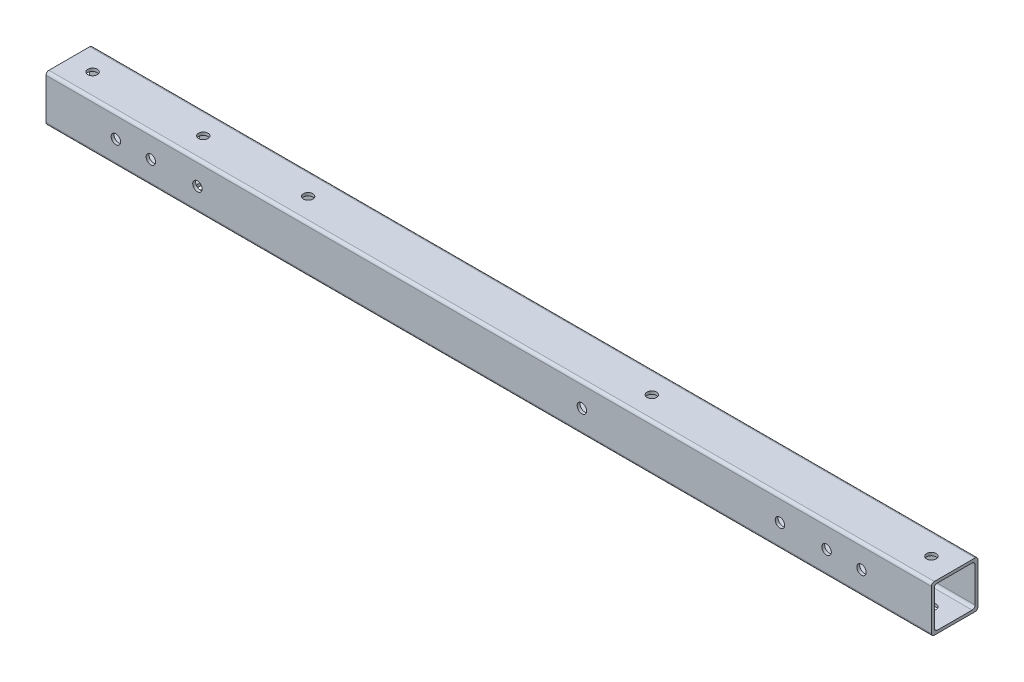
ISO-10303-21;
HEADER;
FILE_DESCRIPTION(('STEP AP214'),'2;1');
FILE_NAME('part.step','',(''),(''),'','','');
FILE_SCHEMA(('AUTOMOTIVE_DESIGN { 1 0 10303 214 1 1 1 1 }'));
ENDSEC;
DATA;
#1=APPLICATION_CONTEXT('core data for automotive mechanical design processes');
#2=APPLICATION_PROTOCOL_DEFINITION('international standard','automotive_design',2000,#1);
#3=PRODUCT_CONTEXT('',#1,'mechanical');
#4=PRODUCT('Part','Part','',(#3));
#5=PRODUCT_RELATED_PRODUCT_CATEGORY('part','',(#4));
#6=PRODUCT_DEFINITION_FORMATION('','',#4);
#7=PRODUCT_DEFINITION_CONTEXT('part definition',#1,'design');
#8=PRODUCT_DEFINITION('design','',#6,#7);
#9=PRODUCT_DEFINITION_SHAPE('','',#8);
#10=(LENGTH_UNIT() NAMED_UNIT(*) SI_UNIT(.MILLI.,.METRE.));
#11=(NAMED_UNIT(*) PLANE_ANGLE_UNIT() SI_UNIT($,.RADIAN.));
#12=(NAMED_UNIT(*) SI_UNIT($,.STERADIAN.) SOLID_ANGLE_UNIT());
#13=UNCERTAINTY_MEASURE_WITH_UNIT(LENGTH_MEASURE(1.E-05),#10,'distance_accuracy_value','');
#14=(GEOMETRIC_REPRESENTATION_CONTEXT(3) GLOBAL_UNCERTAINTY_ASSIGNED_CONTEXT((#13)) GLOBAL_UNIT_ASSIGNED_CONTEXT((#10,
#11,#12)) REPRESENTATION_CONTEXT('',''));
#15=CARTESIAN_POINT('',(0.,0.,0.));
#16=DIRECTION('',(0.,0.,1.));
#17=DIRECTION('',(1.,0.,0.));
#18=AXIS2_PLACEMENT_3D('',#15,#16,#17);
#19=CARTESIAN_POINT('',(0.,101.6,0.));
#20=DIRECTION('',(0.,0.,1.));
#21=DIRECTION('',(1.,0.,0.));
#22=AXIS2_PLACEMENT_3D('',#19,#20,#21);
#23=PLANE('',#22);
#24=CARTESIAN_POINT('',(-762.,50.7999999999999,0.));
#25=DIRECTION('',(0.,0.,-1.));
#26=DIRECTION('',(-1.,0.,0.));
#27=AXIS2_PLACEMENT_3D('',#24,#25,#26);
#28=CIRCLE('',#27,10.31875);
#29=CARTESIAN_POINT('',(-772.31875,50.7999999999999,0.));
#30=VERTEX_POINT('',#29);
#31=EDGE_CURVE('E239',#30,#30,#28,.T.);
#32=ORIENTED_EDGE('',*,*,#31,.F.);
#33=EDGE_LOOP('',(#32));
#34=FACE_BOUND('',#33,.T.);
#35=CARTESIAN_POINT('',(-228.6,50.8,2.08403509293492E-13));
#36=DIRECTION('',(0.,0.,1.));
#37=DIRECTION('',(1.,0.,0.));
#38=AXIS2_PLACEMENT_3D('',#35,#36,#37);
#39=CIRCLE('',#38,10.31875);
#40=CARTESIAN_POINT('',(-218.28125,50.8,2.09667149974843E-13));
#41=VERTEX_POINT('',#40);
#42=EDGE_CURVE('E272',#41,#41,#39,.T.);
#43=ORIENTED_EDGE('',*,*,#42,.T.);
#44=EDGE_LOOP('',(#43));
#45=FACE_BOUND('',#44,.T.);
#46=CARTESIAN_POINT('',(-152.4,50.8,0.));
#47=DIRECTION('',(0.,0.,-1.));
#48=DIRECTION('',(-1.,0.,0.));
#49=AXIS2_PLACEMENT_3D('',#46,#47,#48);
#50=CIRCLE('',#49,10.31875);
#51=CARTESIAN_POINT('',(-162.71875,50.8,0.));
#52=VERTEX_POINT('',#51);
#53=EDGE_CURVE('E279',#52,#52,#50,.T.);
#54=ORIENTED_EDGE('',*,*,#53,.F.);
#55=EDGE_LOOP('',(#54));
#56=FACE_BOUND('',#55,.T.);
#57=CARTESIAN_POINT('',(-1600.2,50.8,1.95961508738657E-13));
#58=DIRECTION('',(0.,0.,-1.));
#59=DIRECTION('',(-1.,0.,0.));
#60=AXIS2_PLACEMENT_3D('',#57,#58,#59);
#61=CIRCLE('',#60,10.31875);
#62=CARTESIAN_POINT('',(-1610.51875,50.8,1.97225149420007E-13));
#63=VERTEX_POINT('',#62);
#64=EDGE_CURVE('E293',#63,#63,#61,.T.);
#65=ORIENTED_EDGE('',*,*,#64,.F.);
#66=EDGE_LOOP('',(#65));
#67=FACE_BOUND('',#66,.T.);
#68=CARTESIAN_POINT('',(-1701.8,50.8,2.08403509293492E-13));
#69=DIRECTION('',(0.,0.,-1.));
#70=DIRECTION('',(-1.,0.,0.));
#71=AXIS2_PLACEMENT_3D('',#68,#69,#70);
#72=CIRCLE('',#71,10.31875);
#73=CARTESIAN_POINT('',(-1712.11875,50.8,2.09667149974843E-13));
#74=VERTEX_POINT('',#73);
#75=EDGE_CURVE('E300',#74,#74,#72,.T.);
#76=ORIENTED_EDGE('',*,*,#75,.F.);
#77=EDGE_LOOP('',(#76));
#78=FACE_BOUND('',#77,.T.);
#79=DIRECTION('',(0.,-1.,0.));
#80=VECTOR('',#79,1.);
#81=CARTESIAN_POINT('',(-1930.4,101.6,2.36398010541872E-13));
#82=LINE('',#81,#80);
#83=CARTESIAN_POINT('',(-1930.4,95.25,2.36398010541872E-13));
#84=VERTEX_POINT('',#83);
#85=CARTESIAN_POINT('',(-1930.4,6.34999999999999,2.36398010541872E-13));
#86=VERTEX_POINT('',#85);
#87=EDGE_CURVE('E358',#84,#86,#82,.T.);
#88=ORIENTED_EDGE('',*,*,#87,.F.);
#89=DIRECTION('',(-1.,0.,0.));
#90=VECTOR('',#89,1.);
#91=CARTESIAN_POINT('',(0.,95.25,0.));
#92=LINE('',#91,#90);
#93=CARTESIAN_POINT('',(0.,95.25,0.));
#94=VERTEX_POINT('',#93);
#95=EDGE_CURVE('E409',#84,#94,#92,.F.);
#96=ORIENTED_EDGE('',*,*,#95,.T.);
#97=DIRECTION('',(0.,-1.,0.));
#98=VECTOR('',#97,1.);
#99=CARTESIAN_POINT('',(0.,101.6,0.));
#100=LINE('',#99,#98);
#101=CARTESIAN_POINT('',(0.,6.34999999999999,0.));
#102=VERTEX_POINT('',#101);
#103=EDGE_CURVE('E160',#94,#102,#100,.T.);
#104=ORIENTED_EDGE('',*,*,#103,.T.);
#105=DIRECTION('',(-1.,0.,0.));
#106=VECTOR('',#105,1.);
#107=CARTESIAN_POINT('',(-1930.4,6.34999999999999,2.36398010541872E-13));
#108=LINE('',#107,#106);
#109=EDGE_CURVE('E407',#102,#86,#108,.T.);
#110=ORIENTED_EDGE('',*,*,#109,.T.);
#111=EDGE_LOOP('',(#88,#96,#104,#110));
#112=FACE_BOUND('',#111,.T.);
#113=CARTESIAN_POINT('',(-1778.,50.8,0.));
#114=DIRECTION('',(0.,0.,1.));
#115=DIRECTION('',(1.,0.,0.));
#116=AXIS2_PLACEMENT_3D('',#113,#114,#115);
#117=CIRCLE('',#116,10.31875);
#118=CARTESIAN_POINT('',(-1767.68125,50.8,0.));
#119=VERTEX_POINT('',#118);
#120=EDGE_CURVE('E307',#119,#119,#117,.T.);
#121=ORIENTED_EDGE('',*,*,#120,.T.);
#122=EDGE_LOOP('',(#121));
#123=FACE_BOUND('',#122,.T.);
#124=CARTESIAN_POINT('',(-330.2,50.8,1.95961508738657E-13));
#125=DIRECTION('',(0.,0.,1.));
#126=DIRECTION('',(1.,0.,0.));
#127=AXIS2_PLACEMENT_3D('',#124,#125,#126);
#128=CIRCLE('',#127,10.31875);
#129=CARTESIAN_POINT('',(-319.88125,50.8,1.97225149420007E-13));
#130=VERTEX_POINT('',#129);
#131=EDGE_CURVE('E265',#130,#130,#128,.T.);
#132=ORIENTED_EDGE('',*,*,#131,.T.);
#133=EDGE_LOOP('',(#132));
#134=FACE_BOUND('',#133,.T.);
#135=ADVANCED_FACE('F31',(#34,#45,#56,#67,#78,#112,#123,#134),#23,.F.);
#136=CARTESIAN_POINT('',(0.,101.6,101.6));
#137=DIRECTION('',(0.,0.,-1.));
#138=DIRECTION('',(-1.,0.,0.));
#139=AXIS2_PLACEMENT_3D('',#136,#137,#138);
#140=PLANE('',#139);
#141=CARTESIAN_POINT('',(-762.,50.7999999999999,101.6));
#142=DIRECTION('',(0.,0.,-1.));
#143=DIRECTION('',(-1.,0.,0.));
#144=AXIS2_PLACEMENT_3D('',#141,#142,#143);
#145=CIRCLE('',#144,10.31875);
#146=CARTESIAN_POINT('',(-772.31875,50.7999999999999,101.6));
#147=VERTEX_POINT('',#146);
#148=EDGE_CURVE('E231',#147,#147,#145,.T.);
#149=ORIENTED_EDGE('',*,*,#148,.T.);
#150=EDGE_LOOP('',(#149));
#151=FACE_BOUND('',#150,.T.);
#152=CARTESIAN_POINT('',(-228.6,50.8,101.6));
#153=DIRECTION('',(0.,0.,1.));
#154=DIRECTION('',(1.,0.,0.));
#155=AXIS2_PLACEMENT_3D('',#152,#153,#154);
#156=CIRCLE('',#155,10.31875);
#157=CARTESIAN_POINT('',(-218.28125,50.8,101.6));
#158=VERTEX_POINT('',#157);
#159=EDGE_CURVE('E217',#158,#158,#156,.T.);
#160=ORIENTED_EDGE('',*,*,#159,.F.);
#161=EDGE_LOOP('',(#160));
#162=FACE_BOUND('',#161,.T.);
#163=CARTESIAN_POINT('',(-152.4,50.8,101.6));
#164=DIRECTION('',(0.,0.,-1.));
#165=DIRECTION('',(-1.,0.,0.));
#166=AXIS2_PLACEMENT_3D('',#163,#164,#165);
#167=CIRCLE('',#166,10.31875);
#168=CARTESIAN_POINT('',(-162.71875,50.8,101.6));
#169=VERTEX_POINT('',#168);
#170=EDGE_CURVE('E212',#169,#169,#167,.T.);
#171=ORIENTED_EDGE('',*,*,#170,.T.);
#172=EDGE_LOOP('',(#171));
#173=FACE_BOUND('',#172,.T.);
#174=CARTESIAN_POINT('',(-1600.2,50.8,101.6));
#175=DIRECTION('',(0.,0.,-1.));
#176=DIRECTION('',(-1.,0.,0.));
#177=AXIS2_PLACEMENT_3D('',#174,#175,#176);
#178=CIRCLE('',#177,10.31875);
#179=CARTESIAN_POINT('',(-1610.51875,50.8,101.6));
#180=VERTEX_POINT('',#179);
#181=EDGE_CURVE('E202',#180,#180,#178,.T.);
#182=ORIENTED_EDGE('',*,*,#181,.T.);
#183=EDGE_LOOP('',(#182));
#184=FACE_BOUND('',#183,.T.);
#185=CARTESIAN_POINT('',(-1701.8,50.8,101.6));
#186=DIRECTION('',(0.,0.,-1.));
#187=DIRECTION('',(-1.,0.,0.));
#188=AXIS2_PLACEMENT_3D('',#185,#186,#187);
#189=CIRCLE('',#188,10.31875);
#190=CARTESIAN_POINT('',(-1712.11875,50.8,101.6));
#191=VERTEX_POINT('',#190);
#192=EDGE_CURVE('E197',#191,#191,#189,.T.);
#193=ORIENTED_EDGE('',*,*,#192,.T.);
#194=EDGE_LOOP('',(#193));
#195=FACE_BOUND('',#194,.T.);
#196=DIRECTION('',(0.,-1.,0.));
#197=VECTOR('',#196,1.);
#198=CARTESIAN_POINT('',(-1930.4,101.6,101.6));
#199=LINE('',#198,#197);
#200=CARTESIAN_POINT('',(-1930.4,95.25,101.6));
#201=VERTEX_POINT('',#200);
#202=CARTESIAN_POINT('',(-1930.4,6.34999999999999,101.6));
#203=VERTEX_POINT('',#202);
#204=EDGE_CURVE('E355',#201,#203,#199,.T.);
#205=ORIENTED_EDGE('',*,*,#204,.T.);
#206=DIRECTION('',(1.,0.,0.));
#207=VECTOR('',#206,1.);
#208=CARTESIAN_POINT('',(0.,6.34999999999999,101.6));
#209=LINE('',#208,#207);
#210=CARTESIAN_POINT('',(0.,6.34999999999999,101.6));
#211=VERTEX_POINT('',#210);
#212=EDGE_CURVE('E372',#203,#211,#209,.T.);
#213=ORIENTED_EDGE('',*,*,#212,.T.);
#214=DIRECTION('',(0.,-1.,0.));
#215=VECTOR('',#214,1.);
#216=CARTESIAN_POINT('',(0.,101.6,101.6));
#217=LINE('',#216,#215);
#218=CARTESIAN_POINT('',(0.,95.25,101.6));
#219=VERTEX_POINT('',#218);
#220=EDGE_CURVE('E348',#219,#211,#217,.T.);
#221=ORIENTED_EDGE('',*,*,#220,.F.);
#222=DIRECTION('',(1.,0.,0.));
#223=VECTOR('',#222,1.);
#224=CARTESIAN_POINT('',(0.,95.25,101.6));
#225=LINE('',#224,#223);
#226=EDGE_CURVE('E370',#219,#201,#225,.F.);
#227=ORIENTED_EDGE('',*,*,#226,.T.);
#228=EDGE_LOOP('',(#205,#213,#221,#227));
#229=FACE_BOUND('',#228,.T.);
#230=CARTESIAN_POINT('',(-1778.,50.8,101.6));
#231=DIRECTION('',(0.,0.,1.));
#232=DIRECTION('',(1.,0.,0.));
#233=AXIS2_PLACEMENT_3D('',#230,#231,#232);
#234=CIRCLE('',#233,10.31875);
#235=CARTESIAN_POINT('',(-1767.68125,50.8,101.6));
#236=VERTEX_POINT('',#235);
#237=EDGE_CURVE('E192',#236,#236,#234,.T.);
#238=ORIENTED_EDGE('',*,*,#237,.F.);
#239=EDGE_LOOP('',(#238));
#240=FACE_BOUND('',#239,.T.);
#241=CARTESIAN_POINT('',(-330.2,50.8,101.6));
#242=DIRECTION('',(0.,0.,1.));
#243=DIRECTION('',(1.,0.,0.));
#244=AXIS2_PLACEMENT_3D('',#241,#242,#243);
#245=CIRCLE('',#244,10.31875);
#246=CARTESIAN_POINT('',(-319.88125,50.8,101.6));
#247=VERTEX_POINT('',#246);
#248=EDGE_CURVE('E222',#247,#247,#245,.T.);
#249=ORIENTED_EDGE('',*,*,#248,.F.);
#250=EDGE_LOOP('',(#249));
#251=FACE_BOUND('',#250,.T.);
#252=ADVANCED_FACE('F438',(#151,#162,#173,#184,#195,#229,#240,#251),#140,.F.);
#253=CARTESIAN_POINT('',(0.000999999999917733,95.25,6.35000000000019));
#254=DIRECTION('',(0.,0.,-1.));
#255=DIRECTION('',(0.,1.,0.));
#256=AXIS2_PLACEMENT_3D('',#253,#254,#255);
#257=PLANE('',#256);
#258=CARTESIAN_POINT('',(-762.,50.7999999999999,6.3500000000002));
#259=DIRECTION('',(0.,0.,-1.));
#260=DIRECTION('',(0.,1.,0.));
#261=AXIS2_PLACEMENT_3D('',#258,#259,#260);
#262=CIRCLE('',#261,10.31875);
#263=CARTESIAN_POINT('',(-762.,61.1187499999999,6.3500000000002));
#264=VERTEX_POINT('',#263);
#265=EDGE_CURVE('E230',#264,#264,#262,.T.);
#266=ORIENTED_EDGE('',*,*,#265,.T.);
#267=EDGE_LOOP('',(#266));
#268=FACE_BOUND('',#267,.T.);
#269=CARTESIAN_POINT('',(-228.6,50.8,6.3500000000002));
#270=DIRECTION('',(0.,0.,-1.));
#271=DIRECTION('',(0.,1.,0.));
#272=AXIS2_PLACEMENT_3D('',#269,#270,#271);
#273=CIRCLE('',#272,10.31875);
#274=CARTESIAN_POINT('',(-228.6,61.11875,6.3500000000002));
#275=VERTEX_POINT('',#274);
#276=EDGE_CURVE('E216',#275,#275,#273,.F.);
#277=ORIENTED_EDGE('',*,*,#276,.F.);
#278=EDGE_LOOP('',(#277));
#279=FACE_BOUND('',#278,.T.);
#280=CARTESIAN_POINT('',(-152.4,50.8,6.3500000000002));
#281=DIRECTION('',(0.,0.,-1.));
#282=DIRECTION('',(0.,1.,0.));
#283=AXIS2_PLACEMENT_3D('',#280,#281,#282);
#284=CIRCLE('',#283,10.31875);
#285=CARTESIAN_POINT('',(-152.4,61.11875,6.3500000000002));
#286=VERTEX_POINT('',#285);
#287=EDGE_CURVE('E211',#286,#286,#284,.T.);
#288=ORIENTED_EDGE('',*,*,#287,.T.);
#289=EDGE_LOOP('',(#288));
#290=FACE_BOUND('',#289,.T.);
#291=CARTESIAN_POINT('',(-1600.2,50.8,6.3500000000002));
#292=DIRECTION('',(0.,0.,-1.));
#293=DIRECTION('',(0.,1.,0.));
#294=AXIS2_PLACEMENT_3D('',#291,#292,#293);
#295=CIRCLE('',#294,10.31875);
#296=CARTESIAN_POINT('',(-1600.2,61.11875,6.3500000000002));
#297=VERTEX_POINT('',#296);
#298=EDGE_CURVE('E201',#297,#297,#295,.T.);
#299=ORIENTED_EDGE('',*,*,#298,.T.);
#300=EDGE_LOOP('',(#299));
#301=FACE_BOUND('',#300,.T.);
#302=CARTESIAN_POINT('',(-1701.8,50.8,6.3500000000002));
#303=DIRECTION('',(0.,0.,-1.));
#304=DIRECTION('',(0.,1.,0.));
#305=AXIS2_PLACEMENT_3D('',#302,#303,#304);
#306=CIRCLE('',#305,10.31875);
#307=CARTESIAN_POINT('',(-1701.8,61.11875,6.3500000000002));
#308=VERTEX_POINT('',#307);
#309=EDGE_CURVE('E196',#308,#308,#306,.T.);
#310=ORIENTED_EDGE('',*,*,#309,.T.);
#311=EDGE_LOOP('',(#310));
#312=FACE_BOUND('',#311,.T.);
#313=DIRECTION('',(0.,1.,0.));
#314=VECTOR('',#313,1.);
#315=CARTESIAN_POINT('',(0.,95.25,6.35000000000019));
#316=LINE('',#315,#314);
#317=CARTESIAN_POINT('',(0.,12.7,6.3500000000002));
#318=VERTEX_POINT('',#317);
#319=CARTESIAN_POINT('',(0.,88.9,6.35000000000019));
#320=VERTEX_POINT('',#319);
#321=EDGE_CURVE('E324',#318,#320,#316,.T.);
#322=ORIENTED_EDGE('',*,*,#321,.T.);
#323=DIRECTION('',(-1.,0.,0.));
#324=VECTOR('',#323,1.);
#325=CARTESIAN_POINT('',(-1930.4,88.9,6.35000000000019));
#326=LINE('',#325,#324);
#327=CARTESIAN_POINT('',(-1930.4,88.9,6.35000000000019));
#328=VERTEX_POINT('',#327);
#329=EDGE_CURVE('E404',#320,#328,#326,.T.);
#330=ORIENTED_EDGE('',*,*,#329,.T.);
#331=DIRECTION('',(0.,-1.,0.));
#332=VECTOR('',#331,1.);
#333=CARTESIAN_POINT('',(-1930.4,95.25,6.35000000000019));
#334=LINE('',#333,#332);
#335=CARTESIAN_POINT('',(-1930.4,12.7,6.3500000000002));
#336=VERTEX_POINT('',#335);
#337=EDGE_CURVE('E327',#328,#336,#334,.T.);
#338=ORIENTED_EDGE('',*,*,#337,.T.);
#339=DIRECTION('',(-1.,0.,0.));
#340=VECTOR('',#339,1.);
#341=CARTESIAN_POINT('',(0.,12.7,6.3500000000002));
#342=LINE('',#341,#340);
#343=EDGE_CURVE('E402',#336,#318,#342,.F.);
#344=ORIENTED_EDGE('',*,*,#343,.T.);
#345=EDGE_LOOP('',(#322,#330,#338,#344));
#346=FACE_BOUND('',#345,.T.);
#347=CARTESIAN_POINT('',(-1778.,50.8,6.3500000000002));
#348=DIRECTION('',(0.,0.,-1.));
#349=DIRECTION('',(0.,1.,0.));
#350=AXIS2_PLACEMENT_3D('',#347,#348,#349);
#351=CIRCLE('',#350,10.31875);
#352=CARTESIAN_POINT('',(-1778.,61.11875,6.3500000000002));
#353=VERTEX_POINT('',#352);
#354=EDGE_CURVE('E191',#353,#353,#351,.F.);
#355=ORIENTED_EDGE('',*,*,#354,.F.);
#356=EDGE_LOOP('',(#355));
#357=FACE_BOUND('',#356,.T.);
#358=CARTESIAN_POINT('',(-330.2,50.8,6.3500000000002));
#359=DIRECTION('',(0.,0.,-1.));
#360=DIRECTION('',(0.,1.,0.));
#361=AXIS2_PLACEMENT_3D('',#358,#359,#360);
#362=CIRCLE('',#361,10.31875);
#363=CARTESIAN_POINT('',(-330.2,61.11875,6.3500000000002));
#364=VERTEX_POINT('',#363);
#365=EDGE_CURVE('E221',#364,#364,#362,.F.);
#366=ORIENTED_EDGE('',*,*,#365,.F.);
#367=EDGE_LOOP('',(#366));
#368=FACE_BOUND('',#367,.T.);
#369=ADVANCED_FACE('F444',(#268,#279,#290,#301,#312,#346,#357,#368),#257,.F.);
#370=CARTESIAN_POINT('',(0.000999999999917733,95.25,95.2500000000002));
#371=DIRECTION('',(0.,0.,1.));
#372=DIRECTION('',(0.,-1.,0.));
#373=AXIS2_PLACEMENT_3D('',#370,#371,#372);
#374=PLANE('',#373);
#375=CARTESIAN_POINT('',(-762.,50.7999999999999,95.2500000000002));
#376=DIRECTION('',(0.,0.,1.));
#377=DIRECTION('',(0.,-1.,0.));
#378=AXIS2_PLACEMENT_3D('',#375,#376,#377);
#379=CIRCLE('',#378,10.31875);
#380=CARTESIAN_POINT('',(-762.,40.4812499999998,95.2500000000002));
#381=VERTEX_POINT('',#380);
#382=EDGE_CURVE('E228',#381,#381,#379,.T.);
#383=ORIENTED_EDGE('',*,*,#382,.T.);
#384=EDGE_LOOP('',(#383));
#385=FACE_BOUND('',#384,.T.);
#386=CARTESIAN_POINT('',(-228.6,50.8,95.2500000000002));
#387=DIRECTION('',(0.,0.,1.));
#388=DIRECTION('',(0.,-1.,0.));
#389=AXIS2_PLACEMENT_3D('',#386,#387,#388);
#390=CIRCLE('',#389,10.31875);
#391=CARTESIAN_POINT('',(-228.6,40.48125,95.2500000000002));
#392=VERTEX_POINT('',#391);
#393=EDGE_CURVE('E213',#392,#392,#390,.F.);
#394=ORIENTED_EDGE('',*,*,#393,.F.);
#395=EDGE_LOOP('',(#394));
#396=FACE_BOUND('',#395,.T.);
#397=CARTESIAN_POINT('',(-152.4,50.8,95.2500000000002));
#398=DIRECTION('',(0.,0.,1.));
#399=DIRECTION('',(0.,-1.,0.));
#400=AXIS2_PLACEMENT_3D('',#397,#398,#399);
#401=CIRCLE('',#400,10.31875);
#402=CARTESIAN_POINT('',(-152.4,40.48125,95.2500000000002));
#403=VERTEX_POINT('',#402);
#404=EDGE_CURVE('E208',#403,#403,#401,.T.);
#405=ORIENTED_EDGE('',*,*,#404,.T.);
#406=EDGE_LOOP('',(#405));
#407=FACE_BOUND('',#406,.T.);
#408=CARTESIAN_POINT('',(-1600.2,50.8,95.2500000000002));
#409=DIRECTION('',(0.,0.,1.));
#410=DIRECTION('',(0.,-1.,0.));
#411=AXIS2_PLACEMENT_3D('',#408,#409,#410);
#412=CIRCLE('',#411,10.31875);
#413=CARTESIAN_POINT('',(-1600.2,40.48125,95.2500000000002));
#414=VERTEX_POINT('',#413);
#415=EDGE_CURVE('E198',#414,#414,#412,.T.);
#416=ORIENTED_EDGE('',*,*,#415,.T.);
#417=EDGE_LOOP('',(#416));
#418=FACE_BOUND('',#417,.T.);
#419=CARTESIAN_POINT('',(-1701.8,50.8,95.2500000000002));
#420=DIRECTION('',(0.,0.,1.));
#421=DIRECTION('',(0.,-1.,0.));
#422=AXIS2_PLACEMENT_3D('',#419,#420,#421);
#423=CIRCLE('',#422,10.31875);
#424=CARTESIAN_POINT('',(-1701.8,40.48125,95.2500000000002));
#425=VERTEX_POINT('',#424);
#426=EDGE_CURVE('E193',#425,#425,#423,.T.);
#427=ORIENTED_EDGE('',*,*,#426,.T.);
#428=EDGE_LOOP('',(#427));
#429=FACE_BOUND('',#428,.T.);
#430=DIRECTION('',(0.,-1.,0.));
#431=VECTOR('',#430,1.);
#432=CARTESIAN_POINT('',(0.,95.25,95.2500000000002));
#433=LINE('',#432,#431);
#434=CARTESIAN_POINT('',(0.,88.9,95.2500000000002));
#435=VERTEX_POINT('',#434);
#436=CARTESIAN_POINT('',(0.,12.7,95.2500000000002));
#437=VERTEX_POINT('',#436);
#438=EDGE_CURVE('E153',#435,#437,#433,.T.);
#439=ORIENTED_EDGE('',*,*,#438,.T.);
#440=DIRECTION('',(-1.,0.,0.));
#441=VECTOR('',#440,1.);
#442=CARTESIAN_POINT('',(-1930.4,12.7,95.2500000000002));
#443=LINE('',#442,#441);
#444=CARTESIAN_POINT('',(-1930.4,12.7,95.2500000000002));
#445=VERTEX_POINT('',#444);
#446=EDGE_CURVE('E159',#437,#445,#443,.T.);
#447=ORIENTED_EDGE('',*,*,#446,.T.);
#448=DIRECTION('',(0.,1.,0.));
#449=VECTOR('',#448,1.);
#450=CARTESIAN_POINT('',(-1930.4,95.25,95.2500000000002));
#451=LINE('',#450,#449);
#452=CARTESIAN_POINT('',(-1930.4,88.9,95.2500000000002));
#453=VERTEX_POINT('',#452);
#454=EDGE_CURVE('E156',#445,#453,#451,.T.);
#455=ORIENTED_EDGE('',*,*,#454,.T.);
#456=DIRECTION('',(-1.,0.,0.));
#457=VECTOR('',#456,1.);
#458=CARTESIAN_POINT('',(0.,88.9,95.2500000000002));
#459=LINE('',#458,#457);
#460=EDGE_CURVE('E148',#453,#435,#459,.F.);
#461=ORIENTED_EDGE('',*,*,#460,.T.);
#462=EDGE_LOOP('',(#439,#447,#455,#461));
#463=FACE_BOUND('',#462,.T.);
#464=CARTESIAN_POINT('',(-1778.,50.8,95.2500000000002));
#465=DIRECTION('',(0.,0.,1.));
#466=DIRECTION('',(0.,-1.,0.));
#467=AXIS2_PLACEMENT_3D('',#464,#465,#466);
#468=CIRCLE('',#467,10.31875);
#469=CARTESIAN_POINT('',(-1778.,40.48125,95.2500000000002));
#470=VERTEX_POINT('',#469);
#471=EDGE_CURVE('E188',#470,#470,#468,.F.);
#472=ORIENTED_EDGE('',*,*,#471,.F.);
#473=EDGE_LOOP('',(#472));
#474=FACE_BOUND('',#473,.T.);
#475=CARTESIAN_POINT('',(-330.2,50.8,95.2500000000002));
#476=DIRECTION('',(0.,0.,1.));
#477=DIRECTION('',(0.,-1.,0.));
#478=AXIS2_PLACEMENT_3D('',#475,#476,#477);
#479=CIRCLE('',#478,10.31875);
#480=CARTESIAN_POINT('',(-330.2,40.48125,95.2500000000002));
#481=VERTEX_POINT('',#480);
#482=EDGE_CURVE('E218',#481,#481,#479,.F.);
#483=ORIENTED_EDGE('',*,*,#482,.F.);
#484=EDGE_LOOP('',(#483));
#485=FACE_BOUND('',#484,.T.);
#486=ADVANCED_FACE('F150',(#385,#396,#407,#418,#429,#463,#474,#485),#374,.F.);
#487=CARTESIAN_POINT('',(0.,101.6,0.));
#488=DIRECTION('',(0.,-1.,0.));
#489=DIRECTION('',(0.,0.,-1.));
#490=AXIS2_PLACEMENT_3D('',#487,#488,#489);
#491=PLANE('',#490);
#492=CARTESIAN_POINT('',(-1638.3,101.6,50.8000000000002));
#493=DIRECTION('',(0.,1.,0.));
#494=DIRECTION('',(0.,0.,1.));
#495=AXIS2_PLACEMENT_3D('',#492,#493,#494);
#496=CIRCLE('',#495,10.31875);
#497=CARTESIAN_POINT('',(-1638.3,101.6,61.1187500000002));
#498=VERTEX_POINT('',#497);
#499=EDGE_CURVE('E823',#498,#498,#496,.T.);
#500=ORIENTED_EDGE('',*,*,#499,.F.);
#501=EDGE_LOOP('',(#500));
#502=FACE_BOUND('',#501,.T.);
#503=CARTESIAN_POINT('',(-1409.7,101.6,50.8000000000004));
#504=DIRECTION('',(0.,1.,0.));
#505=DIRECTION('',(0.,0.,1.));
#506=AXIS2_PLACEMENT_3D('',#503,#504,#505);
#507=CIRCLE('',#506,10.31875);
#508=CARTESIAN_POINT('',(-1409.7,101.6,61.1187500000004));
#509=VERTEX_POINT('',#508);
#510=EDGE_CURVE('E242',#509,#509,#507,.T.);
#511=ORIENTED_EDGE('',*,*,#510,.F.);
#512=EDGE_LOOP('',(#511));
#513=FACE_BOUND('',#512,.T.);
#514=CARTESIAN_POINT('',(-660.4,101.6,50.8000000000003));
#515=DIRECTION('',(0.,1.,0.));
#516=DIRECTION('',(0.,0.,1.));
#517=AXIS2_PLACEMENT_3D('',#514,#515,#516);
#518=CIRCLE('',#517,10.31875);
#519=CARTESIAN_POINT('',(-660.4,101.6,61.1187500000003));
#520=VERTEX_POINT('',#519);
#521=EDGE_CURVE('E258',#520,#520,#518,.T.);
#522=ORIENTED_EDGE('',*,*,#521,.F.);
#523=EDGE_LOOP('',(#522));
#524=FACE_BOUND('',#523,.T.);
#525=DIRECTION('',(0.,0.,1.));
#526=VECTOR('',#525,1.);
#527=CARTESIAN_POINT('',(-1930.4,101.6,2.36398010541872E-13));
#528=LINE('',#527,#526);
#529=CARTESIAN_POINT('',(-1930.4,101.6,6.35000000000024));
#530=VERTEX_POINT('',#529);
#531=CARTESIAN_POINT('',(-1930.4,101.6,95.2500000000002));
#532=VERTEX_POINT('',#531);
#533=EDGE_CURVE('E344',#530,#532,#528,.T.);
#534=ORIENTED_EDGE('',*,*,#533,.T.);
#535=DIRECTION('',(1.,0.,0.));
#536=VECTOR('',#535,1.);
#537=CARTESIAN_POINT('',(0.,101.6,95.25));
#538=LINE('',#537,#536);
#539=CARTESIAN_POINT('',(0.,101.6,95.25));
#540=VERTEX_POINT('',#539);
#541=EDGE_CURVE('E396',#532,#540,#538,.T.);
#542=ORIENTED_EDGE('',*,*,#541,.T.);
#543=DIRECTION('',(0.,0.,-1.));
#544=VECTOR('',#543,1.);
#545=CARTESIAN_POINT('',(0.,101.6,0.));
#546=LINE('',#545,#544);
#547=CARTESIAN_POINT('',(0.,101.6,6.35));
#548=VERTEX_POINT('',#547);
#549=EDGE_CURVE('E341',#540,#548,#546,.T.);
#550=ORIENTED_EDGE('',*,*,#549,.T.);
#551=DIRECTION('',(-1.,0.,0.));
#552=VECTOR('',#551,1.);
#553=CARTESIAN_POINT('',(0.,101.6,6.35));
#554=LINE('',#553,#552);
#555=EDGE_CURVE('E393',#548,#530,#554,.T.);
#556=ORIENTED_EDGE('',*,*,#555,.T.);
#557=EDGE_LOOP('',(#534,#542,#550,#556));
#558=FACE_BOUND('',#557,.T.);
#559=CARTESIAN_POINT('',(-1879.6,101.6,50.8000000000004));
#560=DIRECTION('',(0.,1.,0.));
#561=DIRECTION('',(0.,0.,1.));
#562=AXIS2_PLACEMENT_3D('',#559,#560,#561);
#563=CIRCLE('',#562,10.31875);
#564=CARTESIAN_POINT('',(-1879.6,101.6,61.1187500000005));
#565=VERTEX_POINT('',#564);
#566=EDGE_CURVE('E314',#565,#565,#563,.T.);
#567=ORIENTED_EDGE('',*,*,#566,.F.);
#568=EDGE_LOOP('',(#567));
#569=FACE_BOUND('',#568,.T.);
#570=CARTESIAN_POINT('',(-50.8,101.6,50.8000000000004));
#571=DIRECTION('',(0.,-1.,0.));
#572=DIRECTION('',(0.,0.,1.));
#573=AXIS2_PLACEMENT_3D('',#570,#571,#572);
#574=CIRCLE('',#573,10.31875);
#575=CARTESIAN_POINT('',(-50.8,101.6,61.1187500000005));
#576=VERTEX_POINT('',#575);
#577=EDGE_CURVE('E286',#576,#576,#574,.T.);
#578=ORIENTED_EDGE('',*,*,#577,.T.);
#579=EDGE_LOOP('',(#578));
#580=FACE_BOUND('',#579,.T.);
#581=ADVANCED_FACE('F470',(#502,#513,#524,#558,#569,#580),#491,.F.);
#582=CARTESIAN_POINT('',(0.,0.,0.));
#583=DIRECTION('',(0.,-1.,0.));
#584=DIRECTION('',(0.,0.,-1.));
#585=AXIS2_PLACEMENT_3D('',#582,#583,#584);
#586=PLANE('',#585);
#587=CARTESIAN_POINT('',(-1638.3,0.,50.8000000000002));
#588=DIRECTION('',(0.,1.,0.));
#589=DIRECTION('',(0.,0.,1.));
#590=AXIS2_PLACEMENT_3D('',#587,#588,#589);
#591=CIRCLE('',#590,10.31875);
#592=CARTESIAN_POINT('',(-1638.3,0.,61.1187500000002));
#593=VERTEX_POINT('',#592);
#594=EDGE_CURVE('E480',#593,#593,#591,.T.);
#595=ORIENTED_EDGE('',*,*,#594,.T.);
#596=EDGE_LOOP('',(#595));
#597=FACE_BOUND('',#596,.T.);
#598=CARTESIAN_POINT('',(-1409.7,0.,50.8000000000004));
#599=DIRECTION('',(0.,1.,0.));
#600=DIRECTION('',(0.,0.,1.));
#601=AXIS2_PLACEMENT_3D('',#598,#599,#600);
#602=CIRCLE('',#601,10.31875);
#603=CARTESIAN_POINT('',(-1409.7,0.,61.1187500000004));
#604=VERTEX_POINT('',#603);
#605=EDGE_CURVE('E235',#604,#604,#602,.T.);
#606=ORIENTED_EDGE('',*,*,#605,.T.);
#607=EDGE_LOOP('',(#606));
#608=FACE_BOUND('',#607,.T.);
#609=CARTESIAN_POINT('',(-660.4,0.,50.8000000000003));
#610=DIRECTION('',(0.,1.,0.));
#611=DIRECTION('',(0.,0.,1.));
#612=AXIS2_PLACEMENT_3D('',#609,#610,#611);
#613=CIRCLE('',#612,10.31875);
#614=CARTESIAN_POINT('',(-660.4,0.,61.1187500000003));
#615=VERTEX_POINT('',#614);
#616=EDGE_CURVE('E227',#615,#615,#613,.T.);
#617=ORIENTED_EDGE('',*,*,#616,.T.);
#618=EDGE_LOOP('',(#617));
#619=FACE_BOUND('',#618,.T.);
#620=DIRECTION('',(0.,0.,-1.));
#621=VECTOR('',#620,1.);
#622=CARTESIAN_POINT('',(0.,0.,0.));
#623=LINE('',#622,#621);
#624=CARTESIAN_POINT('',(0.,0.,95.25));
#625=VERTEX_POINT('',#624);
#626=CARTESIAN_POINT('',(0.,0.,6.35));
#627=VERTEX_POINT('',#626);
#628=EDGE_CURVE('E340',#625,#627,#623,.T.);
#629=ORIENTED_EDGE('',*,*,#628,.F.);
#630=DIRECTION('',(1.,0.,0.));
#631=VECTOR('',#630,1.);
#632=CARTESIAN_POINT('',(-1930.4,0.,95.2500000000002));
#633=LINE('',#632,#631);
#634=CARTESIAN_POINT('',(-1930.4,0.,95.2500000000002));
#635=VERTEX_POINT('',#634);
#636=EDGE_CURVE('E385',#625,#635,#633,.F.);
#637=ORIENTED_EDGE('',*,*,#636,.T.);
#638=DIRECTION('',(0.,0.,1.));
#639=VECTOR('',#638,1.);
#640=CARTESIAN_POINT('',(-1930.4,0.,2.36398010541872E-13));
#641=LINE('',#640,#639);
#642=CARTESIAN_POINT('',(-1930.4,0.,6.35000000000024));
#643=VERTEX_POINT('',#642);
#644=EDGE_CURVE('E345',#643,#635,#641,.T.);
#645=ORIENTED_EDGE('',*,*,#644,.F.);
#646=DIRECTION('',(-1.,0.,0.));
#647=VECTOR('',#646,1.);
#648=CARTESIAN_POINT('',(0.,0.,6.35));
#649=LINE('',#648,#647);
#650=EDGE_CURVE('E383',#643,#627,#649,.F.);
#651=ORIENTED_EDGE('',*,*,#650,.T.);
#652=EDGE_LOOP('',(#629,#637,#645,#651));
#653=FACE_BOUND('',#652,.T.);
#654=CARTESIAN_POINT('',(-1879.6,0.,50.8000000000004));
#655=DIRECTION('',(0.,1.,0.));
#656=DIRECTION('',(0.,0.,1.));
#657=AXIS2_PLACEMENT_3D('',#654,#655,#656);
#658=CIRCLE('',#657,10.31875);
#659=CARTESIAN_POINT('',(-1879.6,0.,61.1187500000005));
#660=VERTEX_POINT('',#659);
#661=EDGE_CURVE('E315',#660,#660,#658,.T.);
#662=ORIENTED_EDGE('',*,*,#661,.T.);
#663=EDGE_LOOP('',(#662));
#664=FACE_BOUND('',#663,.T.);
#665=CARTESIAN_POINT('',(-50.8,0.,50.8000000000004));
#666=DIRECTION('',(0.,-1.,0.));
#667=DIRECTION('',(0.,0.,1.));
#668=AXIS2_PLACEMENT_3D('',#665,#666,#667);
#669=CIRCLE('',#668,10.31875);
#670=CARTESIAN_POINT('',(-50.8,0.,61.1187500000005));
#671=VERTEX_POINT('',#670);
#672=EDGE_CURVE('E207',#671,#671,#669,.T.);
#673=ORIENTED_EDGE('',*,*,#672,.F.);
#674=EDGE_LOOP('',(#673));
#675=FACE_BOUND('',#674,.T.);
#676=ADVANCED_FACE('F461',(#597,#608,#619,#653,#664,#675),#586,.T.);
#677=CARTESIAN_POINT('',(0.000999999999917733,95.25,6.35000000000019));
#678=DIRECTION('',(0.,1.,0.));
#679=DIRECTION('',(0.,0.,1.));
#680=AXIS2_PLACEMENT_3D('',#677,#678,#679);
#681=PLANE('',#680);
#682=CARTESIAN_POINT('',(-1638.3,95.25,50.8000000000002));
#683=DIRECTION('',(0.,1.,0.));
#684=DIRECTION('',(0.,0.,1.));
#685=AXIS2_PLACEMENT_3D('',#682,#683,#684);
#686=CIRCLE('',#685,10.31875);
#687=CARTESIAN_POINT('',(-1638.3,95.25,61.1187500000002));
#688=VERTEX_POINT('',#687);
#689=EDGE_CURVE('E247',#688,#688,#686,.T.);
#690=ORIENTED_EDGE('',*,*,#689,.T.);
#691=EDGE_LOOP('',(#690));
#692=FACE_BOUND('',#691,.T.);
#693=CARTESIAN_POINT('',(-1409.7,95.25,50.8000000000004));
#694=DIRECTION('',(0.,1.,0.));
#695=DIRECTION('',(0.,0.,1.));
#696=AXIS2_PLACEMENT_3D('',#693,#694,#695);
#697=CIRCLE('',#696,10.31875);
#698=CARTESIAN_POINT('',(-1409.7,95.25,61.1187500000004));
#699=VERTEX_POINT('',#698);
#700=EDGE_CURVE('E234',#699,#699,#697,.T.);
#701=ORIENTED_EDGE('',*,*,#700,.T.);
#702=EDGE_LOOP('',(#701));
#703=FACE_BOUND('',#702,.T.);
#704=CARTESIAN_POINT('',(-660.4,95.25,50.8000000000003));
#705=DIRECTION('',(0.,1.,0.));
#706=DIRECTION('',(0.,0.,1.));
#707=AXIS2_PLACEMENT_3D('',#704,#705,#706);
#708=CIRCLE('',#707,10.31875);
#709=CARTESIAN_POINT('',(-660.4,95.25,61.1187500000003));
#710=VERTEX_POINT('',#709);
#711=EDGE_CURVE('E226',#710,#710,#708,.T.);
#712=ORIENTED_EDGE('',*,*,#711,.T.);
#713=EDGE_LOOP('',(#712));
#714=FACE_BOUND('',#713,.T.);
#715=DIRECTION('',(0.,0.,1.));
#716=VECTOR('',#715,1.);
#717=CARTESIAN_POINT('',(0.,95.25,6.35000000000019));
#718=LINE('',#717,#716);
#719=CARTESIAN_POINT('',(0.,95.25,12.7000000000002));
#720=VERTEX_POINT('',#719);
#721=CARTESIAN_POINT('',(0.,95.25,88.9000000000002));
#722=VERTEX_POINT('',#721);
#723=EDGE_CURVE('E171',#720,#722,#718,.T.);
#724=ORIENTED_EDGE('',*,*,#723,.T.);
#725=DIRECTION('',(-1.,0.,0.));
#726=VECTOR('',#725,1.);
#727=CARTESIAN_POINT('',(-1930.4,95.25,88.9000000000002));
#728=LINE('',#727,#726);
#729=CARTESIAN_POINT('',(-1930.4,95.25,88.9000000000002));
#730=VERTEX_POINT('',#729);
#731=EDGE_CURVE('E177',#722,#730,#728,.T.);
#732=ORIENTED_EDGE('',*,*,#731,.T.);
#733=DIRECTION('',(0.,0.,-1.));
#734=VECTOR('',#733,1.);
#735=CARTESIAN_POINT('',(-1930.4,95.25,6.35000000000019));
#736=LINE('',#735,#734);
#737=CARTESIAN_POINT('',(-1930.4,95.25,12.7000000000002));
#738=VERTEX_POINT('',#737);
#739=EDGE_CURVE('E334',#730,#738,#736,.T.);
#740=ORIENTED_EDGE('',*,*,#739,.T.);
#741=DIRECTION('',(-1.,0.,0.));
#742=VECTOR('',#741,1.);
#743=CARTESIAN_POINT('',(0.,95.25,12.7000000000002));
#744=LINE('',#743,#742);
#745=EDGE_CURVE('E399',#738,#720,#744,.F.);
#746=ORIENTED_EDGE('',*,*,#745,.T.);
#747=EDGE_LOOP('',(#724,#732,#740,#746));
#748=FACE_BOUND('',#747,.T.);
#749=CARTESIAN_POINT('',(-1879.6,95.25,50.8000000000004));
#750=DIRECTION('',(0.,1.,0.));
#751=DIRECTION('',(0.,0.,1.));
#752=AXIS2_PLACEMENT_3D('',#749,#750,#751);
#753=CIRCLE('',#752,10.31875);
#754=CARTESIAN_POINT('',(-1879.6,95.25,61.1187500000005));
#755=VERTEX_POINT('',#754);
#756=EDGE_CURVE('E172',#755,#755,#753,.T.);
#757=ORIENTED_EDGE('',*,*,#756,.T.);
#758=EDGE_LOOP('',(#757));
#759=FACE_BOUND('',#758,.T.);
#760=CARTESIAN_POINT('',(-50.8,95.25,50.8000000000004));
#761=DIRECTION('',(0.,1.,0.));
#762=DIRECTION('',(0.,0.,1.));
#763=AXIS2_PLACEMENT_3D('',#760,#761,#762);
#764=CIRCLE('',#763,10.31875);
#765=CARTESIAN_POINT('',(-50.8,95.25,61.1187500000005));
#766=VERTEX_POINT('',#765);
#767=EDGE_CURVE('E206',#766,#766,#764,.F.);
#768=ORIENTED_EDGE('',*,*,#767,.F.);
#769=EDGE_LOOP('',(#768));
#770=FACE_BOUND('',#769,.T.);
#771=ADVANCED_FACE('F455',(#692,#703,#714,#748,#759,#770),#681,.F.);
#772=CARTESIAN_POINT('',(0.000999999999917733,6.35,6.35000000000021));
#773=DIRECTION('',(0.,-1.,0.));
#774=DIRECTION('',(0.,0.,-1.));
#775=AXIS2_PLACEMENT_3D('',#772,#773,#774);
#776=PLANE('',#775);
#777=CARTESIAN_POINT('',(-1638.3,6.35,50.8000000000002));
#778=DIRECTION('',(0.,-1.,0.));
#779=DIRECTION('',(0.,0.,-1.));
#780=AXIS2_PLACEMENT_3D('',#777,#778,#779);
#781=CIRCLE('',#780,10.31875);
#782=CARTESIAN_POINT('',(-1638.3,6.35,40.4812500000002));
#783=VERTEX_POINT('',#782);
#784=EDGE_CURVE('E35',#783,#783,#781,.T.);
#785=ORIENTED_EDGE('',*,*,#784,.T.);
#786=EDGE_LOOP('',(#785));
#787=FACE_BOUND('',#786,.T.);
#788=CARTESIAN_POINT('',(-1409.7,6.35,50.8000000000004));
#789=DIRECTION('',(0.,-1.,0.));
#790=DIRECTION('',(0.,0.,-1.));
#791=AXIS2_PLACEMENT_3D('',#788,#789,#790);
#792=CIRCLE('',#791,10.31875);
#793=CARTESIAN_POINT('',(-1409.7,6.35,40.4812500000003));
#794=VERTEX_POINT('',#793);
#795=EDGE_CURVE('E232',#794,#794,#792,.T.);
#796=ORIENTED_EDGE('',*,*,#795,.T.);
#797=EDGE_LOOP('',(#796));
#798=FACE_BOUND('',#797,.T.);
#799=CARTESIAN_POINT('',(-660.4,6.35,50.8000000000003));
#800=DIRECTION('',(0.,-1.,0.));
#801=DIRECTION('',(0.,0.,-1.));
#802=AXIS2_PLACEMENT_3D('',#799,#800,#801);
#803=CIRCLE('',#802,10.31875);
#804=CARTESIAN_POINT('',(-660.4,6.35,40.4812500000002));
#805=VERTEX_POINT('',#804);
#806=EDGE_CURVE('E223',#805,#805,#803,.T.);
#807=ORIENTED_EDGE('',*,*,#806,.T.);
#808=EDGE_LOOP('',(#807));
#809=FACE_BOUND('',#808,.T.);
#810=DIRECTION('',(0.,0.,1.));
#811=VECTOR('',#810,1.);
#812=CARTESIAN_POINT('',(-1930.4,6.35,6.35000000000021));
#813=LINE('',#812,#811);
#814=CARTESIAN_POINT('',(-1930.4,6.35,12.7000000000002));
#815=VERTEX_POINT('',#814);
#816=CARTESIAN_POINT('',(-1930.4,6.35,88.9000000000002));
#817=VERTEX_POINT('',#816);
#818=EDGE_CURVE('E330',#815,#817,#813,.T.);
#819=ORIENTED_EDGE('',*,*,#818,.T.);
#820=DIRECTION('',(-1.,0.,0.));
#821=VECTOR('',#820,1.);
#822=CARTESIAN_POINT('',(0.,6.35,88.9000000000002));
#823=LINE('',#822,#821);
#824=CARTESIAN_POINT('',(0.,6.35,88.9000000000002));
#825=VERTEX_POINT('',#824);
#826=EDGE_CURVE('E368',#817,#825,#823,.F.);
#827=ORIENTED_EDGE('',*,*,#826,.T.);
#828=DIRECTION('',(0.,0.,-1.));
#829=VECTOR('',#828,1.);
#830=CARTESIAN_POINT('',(0.,6.35,6.35000000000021));
#831=LINE('',#830,#829);
#832=CARTESIAN_POINT('',(0.,6.35,12.7000000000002));
#833=VERTEX_POINT('',#832);
#834=EDGE_CURVE('E337',#825,#833,#831,.T.);
#835=ORIENTED_EDGE('',*,*,#834,.T.);
#836=DIRECTION('',(-1.,0.,0.));
#837=VECTOR('',#836,1.);
#838=CARTESIAN_POINT('',(-1930.4,6.35,12.7000000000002));
#839=LINE('',#838,#837);
#840=EDGE_CURVE('E365',#833,#815,#839,.T.);
#841=ORIENTED_EDGE('',*,*,#840,.T.);
#842=EDGE_LOOP('',(#819,#827,#835,#841));
#843=FACE_BOUND('',#842,.T.);
#844=CARTESIAN_POINT('',(-1879.6,6.35,50.8000000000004));
#845=DIRECTION('',(0.,-1.,0.));
#846=DIRECTION('',(0.,0.,-1.));
#847=AXIS2_PLACEMENT_3D('',#844,#845,#846);
#848=CIRCLE('',#847,10.31875);
#849=CARTESIAN_POINT('',(-1879.6,6.35,40.4812500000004));
#850=VERTEX_POINT('',#849);
#851=EDGE_CURVE('E318',#850,#850,#848,.T.);
#852=ORIENTED_EDGE('',*,*,#851,.T.);
#853=EDGE_LOOP('',(#852));
#854=FACE_BOUND('',#853,.T.);
#855=CARTESIAN_POINT('',(-50.8,6.35,50.8000000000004));
#856=DIRECTION('',(0.,-1.,0.));
#857=DIRECTION('',(0.,0.,-1.));
#858=AXIS2_PLACEMENT_3D('',#855,#856,#857);
#859=CIRCLE('',#858,10.31875);
#860=CARTESIAN_POINT('',(-50.8,6.35,40.4812500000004));
#861=VERTEX_POINT('',#860);
#862=EDGE_CURVE('E203',#861,#861,#859,.F.);
#863=ORIENTED_EDGE('',*,*,#862,.F.);
#864=EDGE_LOOP('',(#863));
#865=FACE_BOUND('',#864,.T.);
#866=ADVANCED_FACE('F418',(#787,#798,#809,#843,#854,#865),#776,.F.);
#867=CARTESIAN_POINT('',(0.,101.6,0.));
#868=DIRECTION('',(-1.,0.,0.));
#869=DIRECTION('',(0.,0.,1.));
#870=AXIS2_PLACEMENT_3D('',#867,#868,#869);
#871=PLANE('',#870);
#872=ORIENTED_EDGE('',*,*,#723,.F.);
#873=CARTESIAN_POINT('',(0.,88.9,12.7000000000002));
#874=DIRECTION('',(-1.,0.,0.));
#875=DIRECTION('',(0.,0.,1.));
#876=AXIS2_PLACEMENT_3D('',#873,#874,#875);
#877=CIRCLE('',#876,6.35);
#878=EDGE_CURVE('E181',#720,#320,#877,.T.);
#879=ORIENTED_EDGE('',*,*,#878,.T.);
#880=ORIENTED_EDGE('',*,*,#321,.F.);
#881=CARTESIAN_POINT('',(0.,12.7,12.7000000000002));
#882=DIRECTION('',(-1.,0.,0.));
#883=DIRECTION('',(0.,0.,1.));
#884=AXIS2_PLACEMENT_3D('',#881,#882,#883);
#885=CIRCLE('',#884,6.35);
#886=EDGE_CURVE('E11',#318,#833,#885,.T.);
#887=ORIENTED_EDGE('',*,*,#886,.T.);
#888=ORIENTED_EDGE('',*,*,#834,.F.);
#889=CARTESIAN_POINT('',(0.,12.7,88.9000000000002));
#890=DIRECTION('',(-1.,0.,0.));
#891=DIRECTION('',(0.,0.,1.));
#892=AXIS2_PLACEMENT_3D('',#889,#890,#891);
#893=CIRCLE('',#892,6.35);
#894=EDGE_CURVE('E170',#825,#437,#893,.T.);
#895=ORIENTED_EDGE('',*,*,#894,.T.);
#896=ORIENTED_EDGE('',*,*,#438,.F.);
#897=CARTESIAN_POINT('',(0.,88.9,88.9000000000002));
#898=DIRECTION('',(-1.,0.,0.));
#899=DIRECTION('',(0.,0.,1.));
#900=AXIS2_PLACEMENT_3D('',#897,#898,#899);
#901=CIRCLE('',#900,6.35);
#902=EDGE_CURVE('E166',#435,#722,#901,.T.);
#903=ORIENTED_EDGE('',*,*,#902,.T.);
#904=EDGE_LOOP('',(#872,#879,#880,#887,#888,#895,#896,#903));
#905=FACE_BOUND('',#904,.T.);
#906=ORIENTED_EDGE('',*,*,#220,.T.);
#907=CARTESIAN_POINT('',(0.,6.34999999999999,95.25));
#908=DIRECTION('',(-1.,0.,0.));
#909=DIRECTION('',(0.,0.,1.));
#910=AXIS2_PLACEMENT_3D('',#907,#908,#909);
#911=CIRCLE('',#910,6.35);
#912=EDGE_CURVE('E381',#211,#625,#911,.F.);
#913=ORIENTED_EDGE('',*,*,#912,.T.);
#914=ORIENTED_EDGE('',*,*,#628,.T.);
#915=CARTESIAN_POINT('',(0.,6.34999999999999,6.35));
#916=DIRECTION('',(-1.,0.,0.));
#917=DIRECTION('',(0.,0.,1.));
#918=AXIS2_PLACEMENT_3D('',#915,#916,#917);
#919=CIRCLE('',#918,6.35);
#920=EDGE_CURVE('E375',#627,#102,#919,.F.);
#921=ORIENTED_EDGE('',*,*,#920,.T.);
#922=ORIENTED_EDGE('',*,*,#103,.F.);
#923=CARTESIAN_POINT('',(0.,95.25,6.35));
#924=DIRECTION('',(-1.,0.,0.));
#925=DIRECTION('',(0.,0.,1.));
#926=AXIS2_PLACEMENT_3D('',#923,#924,#925);
#927=CIRCLE('',#926,6.35);
#928=EDGE_CURVE('E377',#94,#548,#927,.F.);
#929=ORIENTED_EDGE('',*,*,#928,.T.);
#930=ORIENTED_EDGE('',*,*,#549,.F.);
#931=CARTESIAN_POINT('',(0.,95.25,95.25));
#932=DIRECTION('',(-1.,0.,0.));
#933=DIRECTION('',(0.,0.,1.));
#934=AXIS2_PLACEMENT_3D('',#931,#932,#933);
#935=CIRCLE('',#934,6.35);
#936=EDGE_CURVE('E379',#540,#219,#935,.F.);
#937=ORIENTED_EDGE('',*,*,#936,.T.);
#938=EDGE_LOOP('',(#906,#913,#914,#921,#922,#929,#930,#937));
#939=FACE_BOUND('',#938,.T.);
#940=ADVANCED_FACE('F164',(#905,#939),#871,.F.);
#941=CARTESIAN_POINT('',(-1930.4,101.6,2.36398010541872E-13));
#942=DIRECTION('',(1.,0.,0.));
#943=DIRECTION('',(0.,0.,-1.));
#944=AXIS2_PLACEMENT_3D('',#941,#942,#943);
#945=PLANE('',#944);
#946=ORIENTED_EDGE('',*,*,#818,.F.);
#947=CARTESIAN_POINT('',(-1930.4,12.7,12.7000000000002));
#948=DIRECTION('',(1.,0.,0.));
#949=DIRECTION('',(0.,0.,-1.));
#950=AXIS2_PLACEMENT_3D('',#947,#948,#949);
#951=CIRCLE('',#950,6.35);
#952=EDGE_CURVE('E40',#815,#336,#951,.T.);
#953=ORIENTED_EDGE('',*,*,#952,.T.);
#954=ORIENTED_EDGE('',*,*,#337,.F.);
#955=CARTESIAN_POINT('',(-1930.4,88.9,12.7000000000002));
#956=DIRECTION('',(1.,0.,0.));
#957=DIRECTION('',(0.,0.,-1.));
#958=AXIS2_PLACEMENT_3D('',#955,#956,#957);
#959=CIRCLE('',#958,6.35);
#960=EDGE_CURVE('E178',#328,#738,#959,.T.);
#961=ORIENTED_EDGE('',*,*,#960,.T.);
#962=ORIENTED_EDGE('',*,*,#739,.F.);
#963=CARTESIAN_POINT('',(-1930.4,88.9,88.9000000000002));
#964=DIRECTION('',(1.,0.,0.));
#965=DIRECTION('',(0.,0.,-1.));
#966=AXIS2_PLACEMENT_3D('',#963,#964,#965);
#967=CIRCLE('',#966,6.35);
#968=EDGE_CURVE('E179',#730,#453,#967,.T.);
#969=ORIENTED_EDGE('',*,*,#968,.T.);
#970=ORIENTED_EDGE('',*,*,#454,.F.);
#971=CARTESIAN_POINT('',(-1930.4,12.7,88.9000000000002));
#972=DIRECTION('',(1.,0.,0.));
#973=DIRECTION('',(0.,0.,-1.));
#974=AXIS2_PLACEMENT_3D('',#971,#972,#973);
#975=CIRCLE('',#974,6.35);
#976=EDGE_CURVE('E411',#445,#817,#975,.T.);
#977=ORIENTED_EDGE('',*,*,#976,.T.);
#978=EDGE_LOOP('',(#946,#953,#954,#961,#962,#969,#970,#977));
#979=FACE_BOUND('',#978,.T.);
#980=ORIENTED_EDGE('',*,*,#644,.T.);
#981=CARTESIAN_POINT('',(-1930.4,6.34999999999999,95.2500000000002));
#982=DIRECTION('',(1.,0.,0.));
#983=DIRECTION('',(0.,0.,-1.));
#984=AXIS2_PLACEMENT_3D('',#981,#982,#983);
#985=CIRCLE('',#984,6.35);
#986=EDGE_CURVE('E391',#635,#203,#985,.F.);
#987=ORIENTED_EDGE('',*,*,#986,.T.);
#988=ORIENTED_EDGE('',*,*,#204,.F.);
#989=CARTESIAN_POINT('',(-1930.4,95.25,95.2500000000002));
#990=DIRECTION('',(1.,0.,0.));
#991=DIRECTION('',(0.,0.,-1.));
#992=AXIS2_PLACEMENT_3D('',#989,#990,#991);
#993=CIRCLE('',#992,6.35);
#994=EDGE_CURVE('E389',#201,#532,#993,.F.);
#995=ORIENTED_EDGE('',*,*,#994,.T.);
#996=ORIENTED_EDGE('',*,*,#533,.F.);
#997=CARTESIAN_POINT('',(-1930.4,95.25,6.35000000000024));
#998=DIRECTION('',(1.,0.,0.));
#999=DIRECTION('',(0.,0.,-1.));
#1000=AXIS2_PLACEMENT_3D('',#997,#998,#999);
#1001=CIRCLE('',#1000,6.35);
#1002=EDGE_CURVE('E56',#530,#84,#1001,.F.);
#1003=ORIENTED_EDGE('',*,*,#1002,.T.);
#1004=ORIENTED_EDGE('',*,*,#87,.T.);
#1005=CARTESIAN_POINT('',(-1930.4,6.34999999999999,6.35000000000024));
#1006=DIRECTION('',(1.,0.,0.));
#1007=DIRECTION('',(0.,0.,-1.));
#1008=AXIS2_PLACEMENT_3D('',#1005,#1006,#1007);
#1009=CIRCLE('',#1008,6.35);
#1010=EDGE_CURVE('E48',#86,#643,#1009,.F.);
#1011=ORIENTED_EDGE('',*,*,#1010,.T.);
#1012=EDGE_LOOP('',(#980,#987,#988,#995,#996,#1003,#1004,#1011));
#1013=FACE_BOUND('',#1012,.T.);
#1014=ADVANCED_FACE('F414',(#979,#1013),#945,.F.);
#1015=CARTESIAN_POINT('',(-1879.6,0.,50.8000000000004));
#1016=DIRECTION('',(0.,1.,0.));
#1017=DIRECTION('',(0.,0.,1.));
#1018=AXIS2_PLACEMENT_3D('',#1015,#1016,#1017);
#1019=CYLINDRICAL_SURFACE('',#1018,10.31875);
#1020=ORIENTED_EDGE('',*,*,#661,.F.);
#1021=EDGE_LOOP('',(#1020));
#1022=FACE_BOUND('',#1021,.T.);
#1023=ORIENTED_EDGE('',*,*,#851,.F.);
#1024=EDGE_LOOP('',(#1023));
#1025=FACE_BOUND('',#1024,.T.);
#1026=ADVANCED_FACE('F433',(#1022,#1025),#1019,.F.);
#1027=ORIENTED_EDGE('',*,*,#566,.T.);
#1028=EDGE_LOOP('',(#1027));
#1029=FACE_BOUND('',#1028,.T.);
#1030=ORIENTED_EDGE('',*,*,#756,.F.);
#1031=EDGE_LOOP('',(#1030));
#1032=FACE_BOUND('',#1031,.T.);
#1033=ADVANCED_FACE('F424',(#1029,#1032),#1019,.F.);
#1034=CARTESIAN_POINT('',(0.000999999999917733,12.7,88.9000000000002));
#1035=DIRECTION('',(1.,0.,0.));
#1036=DIRECTION('',(0.,0.,-1.));
#1037=AXIS2_PLACEMENT_3D('',#1034,#1035,#1036);
#1038=CYLINDRICAL_SURFACE('',#1037,6.35);
#1039=ORIENTED_EDGE('',*,*,#894,.F.);
#1040=ORIENTED_EDGE('',*,*,#826,.F.);
#1041=ORIENTED_EDGE('',*,*,#976,.F.);
#1042=ORIENTED_EDGE('',*,*,#446,.F.);
#1043=EDGE_LOOP('',(#1039,#1040,#1041,#1042));
#1044=FACE_BOUND('',#1043,.T.);
#1045=ADVANCED_FACE('F421',(#1044),#1038,.F.);
#1046=CARTESIAN_POINT('',(0.,6.34999999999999,95.25));
#1047=DIRECTION('',(-1.,0.,0.));
#1048=DIRECTION('',(0.,0.,1.));
#1049=AXIS2_PLACEMENT_3D('',#1046,#1047,#1048);
#1050=CYLINDRICAL_SURFACE('',#1049,6.35);
#1051=ORIENTED_EDGE('',*,*,#986,.F.);
#1052=ORIENTED_EDGE('',*,*,#636,.F.);
#1053=ORIENTED_EDGE('',*,*,#912,.F.);
#1054=ORIENTED_EDGE('',*,*,#212,.F.);
#1055=EDGE_LOOP('',(#1051,#1052,#1053,#1054));
#1056=FACE_BOUND('',#1055,.T.);
#1057=ADVANCED_FACE('F423',(#1056),#1050,.T.);
#1058=CARTESIAN_POINT('',(0.,95.25,95.25));
#1059=DIRECTION('',(1.,0.,0.));
#1060=DIRECTION('',(0.,0.,-1.));
#1061=AXIS2_PLACEMENT_3D('',#1058,#1059,#1060);
#1062=CYLINDRICAL_SURFACE('',#1061,6.35);
#1063=ORIENTED_EDGE('',*,*,#994,.F.);
#1064=ORIENTED_EDGE('',*,*,#226,.F.);
#1065=ORIENTED_EDGE('',*,*,#936,.F.);
#1066=ORIENTED_EDGE('',*,*,#541,.F.);
#1067=EDGE_LOOP('',(#1063,#1064,#1065,#1066));
#1068=FACE_BOUND('',#1067,.T.);
#1069=ADVANCED_FACE('F430',(#1068),#1062,.T.);
#1070=CARTESIAN_POINT('',(0.000999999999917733,88.9,88.9000000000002));
#1071=DIRECTION('',(1.,0.,0.));
#1072=DIRECTION('',(0.,0.,-1.));
#1073=AXIS2_PLACEMENT_3D('',#1070,#1071,#1072);
#1074=CYLINDRICAL_SURFACE('',#1073,6.35);
#1075=ORIENTED_EDGE('',*,*,#902,.F.);
#1076=ORIENTED_EDGE('',*,*,#460,.F.);
#1077=ORIENTED_EDGE('',*,*,#968,.F.);
#1078=ORIENTED_EDGE('',*,*,#731,.F.);
#1079=EDGE_LOOP('',(#1075,#1076,#1077,#1078));
#1080=FACE_BOUND('',#1079,.T.);
#1081=ADVANCED_FACE('F175',(#1080),#1074,.F.);
#1082=CARTESIAN_POINT('',(0.000999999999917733,88.9,12.7000000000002));
#1083=DIRECTION('',(1.,0.,0.));
#1084=DIRECTION('',(0.,0.,-1.));
#1085=AXIS2_PLACEMENT_3D('',#1082,#1083,#1084);
#1086=CYLINDRICAL_SURFACE('',#1085,6.35);
#1087=ORIENTED_EDGE('',*,*,#878,.F.);
#1088=ORIENTED_EDGE('',*,*,#745,.F.);
#1089=ORIENTED_EDGE('',*,*,#960,.F.);
#1090=ORIENTED_EDGE('',*,*,#329,.F.);
#1091=EDGE_LOOP('',(#1087,#1088,#1089,#1090));
#1092=FACE_BOUND('',#1091,.T.);
#1093=ADVANCED_FACE('F576',(#1092),#1086,.F.);
#1094=CARTESIAN_POINT('',(0.,95.25,6.35));
#1095=DIRECTION('',(-1.,0.,0.));
#1096=DIRECTION('',(0.,0.,1.));
#1097=AXIS2_PLACEMENT_3D('',#1094,#1095,#1096);
#1098=CYLINDRICAL_SURFACE('',#1097,6.35);
#1099=ORIENTED_EDGE('',*,*,#928,.F.);
#1100=ORIENTED_EDGE('',*,*,#95,.F.);
#1101=ORIENTED_EDGE('',*,*,#1002,.F.);
#1102=ORIENTED_EDGE('',*,*,#555,.F.);
#1103=EDGE_LOOP('',(#1099,#1100,#1101,#1102));
#1104=FACE_BOUND('',#1103,.T.);
#1105=ADVANCED_FACE('F589',(#1104),#1098,.T.);
#1106=CARTESIAN_POINT('',(0.000999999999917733,12.7,12.7000000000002));
#1107=DIRECTION('',(1.,0.,0.));
#1108=DIRECTION('',(0.,0.,-1.));
#1109=AXIS2_PLACEMENT_3D('',#1106,#1107,#1108);
#1110=CYLINDRICAL_SURFACE('',#1109,6.35);
#1111=ORIENTED_EDGE('',*,*,#886,.F.);
#1112=ORIENTED_EDGE('',*,*,#343,.F.);
#1113=ORIENTED_EDGE('',*,*,#952,.F.);
#1114=ORIENTED_EDGE('',*,*,#840,.F.);
#1115=EDGE_LOOP('',(#1111,#1112,#1113,#1114));
#1116=FACE_BOUND('',#1115,.T.);
#1117=ADVANCED_FACE('F587',(#1116),#1110,.F.);
#1118=CARTESIAN_POINT('',(0.,6.34999999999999,6.35));
#1119=DIRECTION('',(1.,0.,0.));
#1120=DIRECTION('',(0.,0.,-1.));
#1121=AXIS2_PLACEMENT_3D('',#1118,#1119,#1120);
#1122=CYLINDRICAL_SURFACE('',#1121,6.35);
#1123=ORIENTED_EDGE('',*,*,#920,.F.);
#1124=ORIENTED_EDGE('',*,*,#650,.F.);
#1125=ORIENTED_EDGE('',*,*,#1010,.F.);
#1126=ORIENTED_EDGE('',*,*,#109,.F.);
#1127=EDGE_LOOP('',(#1123,#1124,#1125,#1126));
#1128=FACE_BOUND('',#1127,.T.);
#1129=ADVANCED_FACE('F33',(#1128),#1122,.T.);
#1130=CARTESIAN_POINT('',(-1778.,50.8,101.6));
#1131=DIRECTION('',(0.,0.,-1.));
#1132=DIRECTION('',(-1.,0.,0.));
#1133=AXIS2_PLACEMENT_3D('',#1130,#1131,#1132);
#1134=CYLINDRICAL_SURFACE('',#1133,10.31875);
#1135=ORIENTED_EDGE('',*,*,#237,.T.);
#1136=EDGE_LOOP('',(#1135));
#1137=FACE_BOUND('',#1136,.T.);
#1138=ORIENTED_EDGE('',*,*,#471,.T.);
#1139=EDGE_LOOP('',(#1138));
#1140=FACE_BOUND('',#1139,.T.);
#1141=ADVANCED_FACE('F519',(#1137,#1140),#1134,.F.);
#1142=ORIENTED_EDGE('',*,*,#120,.F.);
#1143=EDGE_LOOP('',(#1142));
#1144=FACE_BOUND('',#1143,.T.);
#1145=ORIENTED_EDGE('',*,*,#354,.T.);
#1146=EDGE_LOOP('',(#1145));
#1147=FACE_BOUND('',#1146,.T.);
#1148=ADVANCED_FACE('F517',(#1144,#1147),#1134,.F.);
#1149=CARTESIAN_POINT('',(-1701.8,50.8,101.6));
#1150=DIRECTION('',(0.,0.,-1.));
#1151=DIRECTION('',(-1.,0.,0.));
#1152=AXIS2_PLACEMENT_3D('',#1149,#1150,#1151);
#1153=CYLINDRICAL_SURFACE('',#1152,10.31875);
#1154=ORIENTED_EDGE('',*,*,#192,.F.);
#1155=EDGE_LOOP('',(#1154));
#1156=FACE_BOUND('',#1155,.T.);
#1157=ORIENTED_EDGE('',*,*,#426,.F.);
#1158=EDGE_LOOP('',(#1157));
#1159=FACE_BOUND('',#1158,.T.);
#1160=ADVANCED_FACE('F515',(#1156,#1159),#1153,.F.);
#1161=ORIENTED_EDGE('',*,*,#75,.T.);
#1162=EDGE_LOOP('',(#1161));
#1163=FACE_BOUND('',#1162,.T.);
#1164=ORIENTED_EDGE('',*,*,#309,.F.);
#1165=EDGE_LOOP('',(#1164));
#1166=FACE_BOUND('',#1165,.T.);
#1167=ADVANCED_FACE('F512',(#1163,#1166),#1153,.F.);
#1168=CARTESIAN_POINT('',(-1600.2,50.8,101.6));
#1169=DIRECTION('',(0.,0.,-1.));
#1170=DIRECTION('',(-1.,0.,0.));
#1171=AXIS2_PLACEMENT_3D('',#1168,#1169,#1170);
#1172=CYLINDRICAL_SURFACE('',#1171,10.31875);
#1173=ORIENTED_EDGE('',*,*,#181,.F.);
#1174=EDGE_LOOP('',(#1173));
#1175=FACE_BOUND('',#1174,.T.);
#1176=ORIENTED_EDGE('',*,*,#415,.F.);
#1177=EDGE_LOOP('',(#1176));
#1178=FACE_BOUND('',#1177,.T.);
#1179=ADVANCED_FACE('F505',(#1175,#1178),#1172,.F.);
#1180=ORIENTED_EDGE('',*,*,#64,.T.);
#1181=EDGE_LOOP('',(#1180));
#1182=FACE_BOUND('',#1181,.T.);
#1183=ORIENTED_EDGE('',*,*,#298,.F.);
#1184=EDGE_LOOP('',(#1183));
#1185=FACE_BOUND('',#1184,.T.);
#1186=ADVANCED_FACE('F495',(#1182,#1185),#1172,.F.);
#1187=CARTESIAN_POINT('',(-50.8,0.,50.8000000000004));
#1188=DIRECTION('',(0.,1.,0.));
#1189=DIRECTION('',(0.,0.,1.));
#1190=AXIS2_PLACEMENT_3D('',#1187,#1188,#1189);
#1191=CYLINDRICAL_SURFACE('',#1190,10.31875);
#1192=ORIENTED_EDGE('',*,*,#672,.T.);
#1193=EDGE_LOOP('',(#1192));
#1194=FACE_BOUND('',#1193,.T.);
#1195=ORIENTED_EDGE('',*,*,#862,.T.);
#1196=EDGE_LOOP('',(#1195));
#1197=FACE_BOUND('',#1196,.T.);
#1198=ADVANCED_FACE('F491',(#1194,#1197),#1191,.F.);
#1199=ORIENTED_EDGE('',*,*,#577,.F.);
#1200=EDGE_LOOP('',(#1199));
#1201=FACE_BOUND('',#1200,.T.);
#1202=ORIENTED_EDGE('',*,*,#767,.T.);
#1203=EDGE_LOOP('',(#1202));
#1204=FACE_BOUND('',#1203,.T.);
#1205=ADVANCED_FACE('F494',(#1201,#1204),#1191,.F.);
#1206=CARTESIAN_POINT('',(-152.4,50.8,101.6));
#1207=DIRECTION('',(0.,0.,-1.));
#1208=DIRECTION('',(-1.,0.,0.));
#1209=AXIS2_PLACEMENT_3D('',#1206,#1207,#1208);
#1210=CYLINDRICAL_SURFACE('',#1209,10.31875);
#1211=ORIENTED_EDGE('',*,*,#170,.F.);
#1212=EDGE_LOOP('',(#1211));
#1213=FACE_BOUND('',#1212,.T.);
#1214=ORIENTED_EDGE('',*,*,#404,.F.);
#1215=EDGE_LOOP('',(#1214));
#1216=FACE_BOUND('',#1215,.T.);
#1217=ADVANCED_FACE('F503',(#1213,#1216),#1210,.F.);
#1218=ORIENTED_EDGE('',*,*,#53,.T.);
#1219=EDGE_LOOP('',(#1218));
#1220=FACE_BOUND('',#1219,.T.);
#1221=ORIENTED_EDGE('',*,*,#287,.F.);
#1222=EDGE_LOOP('',(#1221));
#1223=FACE_BOUND('',#1222,.T.);
#1224=ADVANCED_FACE('F509',(#1220,#1223),#1210,.F.);
#1225=CARTESIAN_POINT('',(-228.6,50.8,101.6));
#1226=DIRECTION('',(0.,0.,-1.));
#1227=DIRECTION('',(-1.,0.,0.));
#1228=AXIS2_PLACEMENT_3D('',#1225,#1226,#1227);
#1229=CYLINDRICAL_SURFACE('',#1228,10.31875);
#1230=ORIENTED_EDGE('',*,*,#159,.T.);
#1231=EDGE_LOOP('',(#1230));
#1232=FACE_BOUND('',#1231,.T.);
#1233=ORIENTED_EDGE('',*,*,#393,.T.);
#1234=EDGE_LOOP('',(#1233));
#1235=FACE_BOUND('',#1234,.T.);
#1236=ADVANCED_FACE('F552',(#1232,#1235),#1229,.F.);
#1237=ORIENTED_EDGE('',*,*,#42,.F.);
#1238=EDGE_LOOP('',(#1237));
#1239=FACE_BOUND('',#1238,.T.);
#1240=ORIENTED_EDGE('',*,*,#276,.T.);
#1241=EDGE_LOOP('',(#1240));
#1242=FACE_BOUND('',#1241,.T.);
#1243=ADVANCED_FACE('F547',(#1239,#1242),#1229,.F.);
#1244=CARTESIAN_POINT('',(-330.2,50.8,101.6));
#1245=DIRECTION('',(0.,0.,-1.));
#1246=DIRECTION('',(-1.,0.,0.));
#1247=AXIS2_PLACEMENT_3D('',#1244,#1245,#1246);
#1248=CYLINDRICAL_SURFACE('',#1247,10.31875);
#1249=ORIENTED_EDGE('',*,*,#248,.T.);
#1250=EDGE_LOOP('',(#1249));
#1251=FACE_BOUND('',#1250,.T.);
#1252=ORIENTED_EDGE('',*,*,#482,.T.);
#1253=EDGE_LOOP('',(#1252));
#1254=FACE_BOUND('',#1253,.T.);
#1255=ADVANCED_FACE('F537',(#1251,#1254),#1248,.F.);
#1256=ORIENTED_EDGE('',*,*,#131,.F.);
#1257=EDGE_LOOP('',(#1256));
#1258=FACE_BOUND('',#1257,.T.);
#1259=ORIENTED_EDGE('',*,*,#365,.T.);
#1260=EDGE_LOOP('',(#1259));
#1261=FACE_BOUND('',#1260,.T.);
#1262=ADVANCED_FACE('F534',(#1258,#1261),#1248,.F.);
#1263=CARTESIAN_POINT('',(-660.4,0.,50.8000000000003));
#1264=DIRECTION('',(0.,1.,0.));
#1265=DIRECTION('',(0.,0.,1.));
#1266=AXIS2_PLACEMENT_3D('',#1263,#1264,#1265);
#1267=CYLINDRICAL_SURFACE('',#1266,10.31875);
#1268=ORIENTED_EDGE('',*,*,#616,.F.);
#1269=EDGE_LOOP('',(#1268));
#1270=FACE_BOUND('',#1269,.T.);
#1271=ORIENTED_EDGE('',*,*,#806,.F.);
#1272=EDGE_LOOP('',(#1271));
#1273=FACE_BOUND('',#1272,.T.);
#1274=ADVANCED_FACE('F536',(#1270,#1273),#1267,.F.);
#1275=ORIENTED_EDGE('',*,*,#521,.T.);
#1276=EDGE_LOOP('',(#1275));
#1277=FACE_BOUND('',#1276,.T.);
#1278=ORIENTED_EDGE('',*,*,#711,.F.);
#1279=EDGE_LOOP('',(#1278));
#1280=FACE_BOUND('',#1279,.T.);
#1281=ADVANCED_FACE('F544',(#1277,#1280),#1267,.F.);
#1282=CARTESIAN_POINT('',(-762.,50.7999999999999,101.6));
#1283=DIRECTION('',(0.,0.,-1.));
#1284=DIRECTION('',(-1.,0.,0.));
#1285=AXIS2_PLACEMENT_3D('',#1282,#1283,#1284);
#1286=CYLINDRICAL_SURFACE('',#1285,10.31875);
#1287=ORIENTED_EDGE('',*,*,#148,.F.);
#1288=EDGE_LOOP('',(#1287));
#1289=FACE_BOUND('',#1288,.T.);
#1290=ORIENTED_EDGE('',*,*,#382,.F.);
#1291=EDGE_LOOP('',(#1290));
#1292=FACE_BOUND('',#1291,.T.);
#1293=ADVANCED_FACE('F724',(#1289,#1292),#1286,.F.);
#1294=ORIENTED_EDGE('',*,*,#31,.T.);
#1295=EDGE_LOOP('',(#1294));
#1296=FACE_BOUND('',#1295,.T.);
#1297=ORIENTED_EDGE('',*,*,#265,.F.);
#1298=EDGE_LOOP('',(#1297));
#1299=FACE_BOUND('',#1298,.T.);
#1300=ADVANCED_FACE('F752',(#1296,#1299),#1286,.F.);
#1301=CARTESIAN_POINT('',(-1409.7,0.,50.8000000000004));
#1302=DIRECTION('',(0.,1.,0.));
#1303=DIRECTION('',(0.,0.,1.));
#1304=AXIS2_PLACEMENT_3D('',#1301,#1302,#1303);
#1305=CYLINDRICAL_SURFACE('',#1304,10.31875);
#1306=ORIENTED_EDGE('',*,*,#605,.F.);
#1307=EDGE_LOOP('',(#1306));
#1308=FACE_BOUND('',#1307,.T.);
#1309=ORIENTED_EDGE('',*,*,#795,.F.);
#1310=EDGE_LOOP('',(#1309));
#1311=FACE_BOUND('',#1310,.T.);
#1312=ADVANCED_FACE('F761',(#1308,#1311),#1305,.F.);
#1313=ORIENTED_EDGE('',*,*,#510,.T.);
#1314=EDGE_LOOP('',(#1313));
#1315=FACE_BOUND('',#1314,.T.);
#1316=ORIENTED_EDGE('',*,*,#700,.F.);
#1317=EDGE_LOOP('',(#1316));
#1318=FACE_BOUND('',#1317,.T.);
#1319=ADVANCED_FACE('F770',(#1315,#1318),#1305,.F.);
#1320=CARTESIAN_POINT('',(-1638.3,0.,50.8000000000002));
#1321=DIRECTION('',(0.,1.,0.));
#1322=DIRECTION('',(0.,0.,1.));
#1323=AXIS2_PLACEMENT_3D('',#1320,#1321,#1322);
#1324=CYLINDRICAL_SURFACE('',#1323,10.31875);
#1325=ORIENTED_EDGE('',*,*,#594,.F.);
#1326=EDGE_LOOP('',(#1325));
#1327=FACE_BOUND('',#1326,.T.);
#1328=ORIENTED_EDGE('',*,*,#784,.F.);
#1329=EDGE_LOOP('',(#1328));
#1330=FACE_BOUND('',#1329,.T.);
#1331=ADVANCED_FACE('F780',(#1327,#1330),#1324,.F.);
#1332=ORIENTED_EDGE('',*,*,#499,.T.);
#1333=EDGE_LOOP('',(#1332));
#1334=FACE_BOUND('',#1333,.T.);
#1335=ORIENTED_EDGE('',*,*,#689,.F.);
#1336=EDGE_LOOP('',(#1335));
#1337=FACE_BOUND('',#1336,.T.);
#1338=ADVANCED_FACE('F807',(#1334,#1337),#1324,.F.);
#1339=CLOSED_SHELL('',(#135,#252,#369,#486,#581,#676,#771,#866,#940,#1014,#1026,#1033,#1045,
#1057,#1069,#1081,#1093,#1105,#1117,#1129,#1141,#1148,#1160,#1167,#1179,#1186,#1198,#1205,#1217,
#1224,#1236,#1243,#1255,#1262,#1274,#1281,#1293,#1300,#1312,#1319,#1331,#1338));
#1340=MANIFOLD_SOLID_BREP('B2',#1339);
#1341=ADVANCED_BREP_SHAPE_REPRESENTATION('',(#18,#1340),#14);
#1342=SHAPE_DEFINITION_REPRESENTATION(#9,#1341);
ENDSEC;
END-ISO-10303-21;
